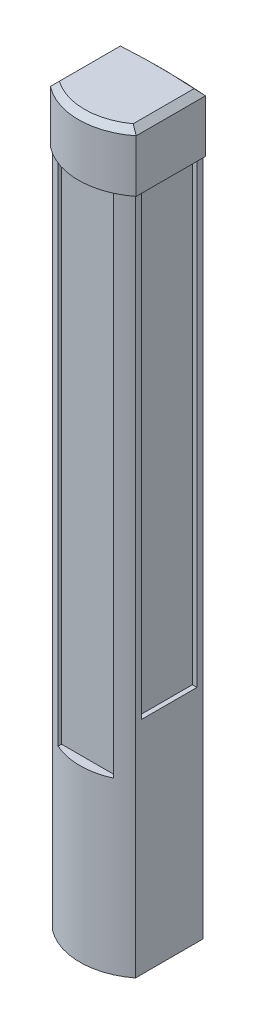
ISO-10303-21;
HEADER;
FILE_DESCRIPTION(('STEP AP214'),'2;1');
FILE_NAME('part.step','',(''),(''),'','','');
FILE_SCHEMA(('AUTOMOTIVE_DESIGN { 1 0 10303 214 1 1 1 1 }'));
ENDSEC;
DATA;
#1=APPLICATION_CONTEXT('core data for automotive mechanical design processes');
#2=APPLICATION_PROTOCOL_DEFINITION('international standard','automotive_design',2000,#1);
#3=PRODUCT_CONTEXT('',#1,'mechanical');
#4=PRODUCT('Part','Part','',(#3));
#5=PRODUCT_RELATED_PRODUCT_CATEGORY('part','',(#4));
#6=PRODUCT_DEFINITION_FORMATION('','',#4);
#7=PRODUCT_DEFINITION_CONTEXT('part definition',#1,'design');
#8=PRODUCT_DEFINITION('design','',#6,#7);
#9=PRODUCT_DEFINITION_SHAPE('','',#8);
#10=(LENGTH_UNIT() NAMED_UNIT(*) SI_UNIT(.MILLI.,.METRE.));
#11=(NAMED_UNIT(*) PLANE_ANGLE_UNIT() SI_UNIT($,.RADIAN.));
#12=(NAMED_UNIT(*) SI_UNIT($,.STERADIAN.) SOLID_ANGLE_UNIT());
#13=UNCERTAINTY_MEASURE_WITH_UNIT(LENGTH_MEASURE(1.E-05),#10,'distance_accuracy_value','');
#14=(GEOMETRIC_REPRESENTATION_CONTEXT(3) GLOBAL_UNCERTAINTY_ASSIGNED_CONTEXT((#13)) GLOBAL_UNIT_ASSIGNED_CONTEXT((#10,
#11,#12)) REPRESENTATION_CONTEXT('',''));
#15=CARTESIAN_POINT('',(0.,0.,0.));
#16=DIRECTION('',(0.,0.,1.));
#17=DIRECTION('',(1.,0.,0.));
#18=AXIS2_PLACEMENT_3D('',#15,#16,#17);
#19=CARTESIAN_POINT('',(90.1110219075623,1600.,-76.6253552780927));
#20=DIRECTION('',(-1.,0.,0.));
#21=DIRECTION('',(0.,0.,1.));
#22=AXIS2_PLACEMENT_3D('',#19,#20,#21);
#23=PLANE('',#22);
#24=DIRECTION('',(0.,0.,-1.));
#25=VECTOR('',#24,1.);
#26=CARTESIAN_POINT('',(90.1110219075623,1473.,59.6709747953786));
#27=LINE('',#26,#25);
#28=CARTESIAN_POINT('',(90.1110219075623,1473.,59.6709747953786));
#29=VERTEX_POINT('',#28);
#30=CARTESIAN_POINT('',(90.1110219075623,1473.,46.6709747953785));
#31=VERTEX_POINT('',#30);
#32=EDGE_CURVE('E522',#29,#31,#27,.T.);
#33=ORIENTED_EDGE('',*,*,#32,.F.);
#34=DIRECTION('',(0.,-1.,0.));
#35=VECTOR('',#34,1.);
#36=CARTESIAN_POINT('',(90.1110219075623,1600.,59.6709747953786));
#37=LINE('',#36,#35);
#38=CARTESIAN_POINT('',(90.1110219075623,0.,59.6709747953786));
#39=VERTEX_POINT('',#38);
#40=EDGE_CURVE('E401',#29,#39,#37,.T.);
#41=ORIENTED_EDGE('',*,*,#40,.T.);
#42=DIRECTION('',(0.,0.,-1.));
#43=VECTOR('',#42,1.);
#44=CARTESIAN_POINT('',(90.1110219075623,0.,-76.6253552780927));
#45=LINE('',#44,#43);
#46=CARTESIAN_POINT('',(90.1110219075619,0.,-86.8585656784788));
#47=VERTEX_POINT('',#46);
#48=EDGE_CURVE('E398',#39,#47,#45,.T.);
#49=ORIENTED_EDGE('',*,*,#48,.T.);
#50=DIRECTION('',(0.,-1.,0.));
#51=VECTOR('',#50,1.);
#52=CARTESIAN_POINT('',(90.1110219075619,1600.,-86.8585656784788));
#53=LINE('',#52,#51);
#54=CARTESIAN_POINT('',(90.1110219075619,1473.,-86.8585656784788));
#55=VERTEX_POINT('',#54);
#56=EDGE_CURVE('E407',#55,#47,#53,.T.);
#57=ORIENTED_EDGE('',*,*,#56,.F.);
#58=CARTESIAN_POINT('',(90.1110219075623,1473.,-74.0912342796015));
#59=VERTEX_POINT('',#58);
#60=EDGE_CURVE('E512',#59,#55,#27,.T.);
#61=ORIENTED_EDGE('',*,*,#60,.F.);
#62=DIRECTION('',(0.,-1.,0.));
#63=VECTOR('',#62,1.);
#64=CARTESIAN_POINT('',(90.1110219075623,1475.,-74.0912342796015));
#65=LINE('',#64,#63);
#66=CARTESIAN_POINT('',(90.1110219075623,480.,-74.0912342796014));
#67=VERTEX_POINT('',#66);
#68=EDGE_CURVE('E296',#59,#67,#65,.T.);
#69=ORIENTED_EDGE('',*,*,#68,.T.);
#70=DIRECTION('',(0.,0.,1.));
#71=VECTOR('',#70,1.);
#72=CARTESIAN_POINT('',(90.1110219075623,480.,-74.0912342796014));
#73=LINE('',#72,#71);
#74=CARTESIAN_POINT('',(90.1110219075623,480.,46.6709747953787));
#75=VERTEX_POINT('',#74);
#76=EDGE_CURVE('E306',#67,#75,#73,.T.);
#77=ORIENTED_EDGE('',*,*,#76,.T.);
#78=DIRECTION('',(0.,1.,0.));
#79=VECTOR('',#78,1.);
#80=CARTESIAN_POINT('',(90.1110219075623,1475.,46.6709747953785));
#81=LINE('',#80,#79);
#82=EDGE_CURVE('E319',#75,#31,#81,.T.);
#83=ORIENTED_EDGE('',*,*,#82,.T.);
#84=EDGE_LOOP('',(#33,#41,#49,#57,#61,#69,#77,#83));
#85=FACE_BOUND('',#84,.T.);
#86=ADVANCED_FACE('F40',(#85),#23,.F.);
#87=CARTESIAN_POINT('',(0.,1600.,-57.0674149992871));
#88=DIRECTION('',(0.,-1.,0.));
#89=DIRECTION('',(0.,0.,-1.));
#90=AXIS2_PLACEMENT_3D('',#87,#88,#89);
#91=CYLINDRICAL_SURFACE('',#90,147.471515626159);
#92=CARTESIAN_POINT('',(0.,1473.,-57.0674149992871));
#93=DIRECTION('',(0.,1.,0.));
#94=DIRECTION('',(0.,0.,1.));
#95=AXIS2_PLACEMENT_3D('',#92,#93,#94);
#96=CIRCLE('',#95,147.471515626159);
#97=CARTESIAN_POINT('',(60.1110219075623,1473.,77.5970308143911));
#98=VERTEX_POINT('',#97);
#99=EDGE_CURVE('E526',#98,#29,#96,.T.);
#100=ORIENTED_EDGE('',*,*,#99,.F.);
#101=DIRECTION('',(0.,-1.,0.));
#102=VECTOR('',#101,1.);
#103=CARTESIAN_POINT('',(60.1110219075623,1600.,77.5970308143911));
#104=LINE('',#103,#102);
#105=CARTESIAN_POINT('',(60.1110219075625,370.,77.5970308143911));
#106=VERTEX_POINT('',#105);
#107=EDGE_CURVE('E412',#98,#106,#104,.T.);
#108=ORIENTED_EDGE('',*,*,#107,.T.);
#109=CARTESIAN_POINT('',(0.,370.,-57.0674149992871));
#110=DIRECTION('',(0.,1.,0.));
#111=DIRECTION('',(0.,0.,1.));
#112=AXIS2_PLACEMENT_3D('',#109,#110,#111);
#113=CIRCLE('',#112,147.471515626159);
#114=CARTESIAN_POINT('',(-60.1110219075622,370.,77.5970308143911));
#115=VERTEX_POINT('',#114);
#116=EDGE_CURVE('E416',#115,#106,#113,.T.);
#117=ORIENTED_EDGE('',*,*,#116,.F.);
#118=DIRECTION('',(0.,-1.,0.));
#119=VECTOR('',#118,1.);
#120=CARTESIAN_POINT('',(-60.1110219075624,1600.,77.597030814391));
#121=LINE('',#120,#119);
#122=CARTESIAN_POINT('',(-60.1110219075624,1473.,77.597030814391));
#123=VERTEX_POINT('',#122);
#124=EDGE_CURVE('E419',#123,#115,#121,.T.);
#125=ORIENTED_EDGE('',*,*,#124,.F.);
#126=CARTESIAN_POINT('',(-90.1110219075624,1473.,59.6709747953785));
#127=VERTEX_POINT('',#126);
#128=EDGE_CURVE('E520',#127,#123,#96,.T.);
#129=ORIENTED_EDGE('',*,*,#128,.F.);
#130=DIRECTION('',(0.,-1.,0.));
#131=VECTOR('',#130,1.);
#132=CARTESIAN_POINT('',(-90.1110219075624,1600.,59.6709747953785));
#133=LINE('',#132,#131);
#134=CARTESIAN_POINT('',(-90.1110219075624,0.,59.6709747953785));
#135=VERTEX_POINT('',#134);
#136=EDGE_CURVE('E403',#127,#135,#133,.T.);
#137=ORIENTED_EDGE('',*,*,#136,.T.);
#138=CARTESIAN_POINT('',(0.,0.,-57.0674149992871));
#139=DIRECTION('',(0.,1.,0.));
#140=DIRECTION('',(0.,0.,1.));
#141=AXIS2_PLACEMENT_3D('',#138,#139,#140);
#142=CIRCLE('',#141,147.471515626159);
#143=EDGE_CURVE('E395',#135,#39,#142,.T.);
#144=ORIENTED_EDGE('',*,*,#143,.T.);
#145=ORIENTED_EDGE('',*,*,#40,.F.);
#146=EDGE_LOOP('',(#100,#108,#117,#125,#129,#137,#144,#145));
#147=FACE_BOUND('',#146,.T.);
#148=ADVANCED_FACE('F484',(#147),#91,.T.);
#149=CARTESIAN_POINT('',(-1.52671845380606,1600.,1095.60117065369));
#150=DIRECTION('',(0.,-1.,0.));
#151=DIRECTION('',(0.,0.,-1.));
#152=AXIS2_PLACEMENT_3D('',#149,#150,#151);
#153=CYLINDRICAL_SURFACE('',#152,1186.00527128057);
#154=CARTESIAN_POINT('',(-1.52671845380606,1473.,1095.60117065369));
#155=DIRECTION('',(0.,1.,0.));
#156=DIRECTION('',(0.,0.,1.));
#157=AXIS2_PLACEMENT_3D('',#154,#155,#156);
#158=CIRCLE('',#157,1186.00527128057);
#159=CARTESIAN_POINT('',(60.1110219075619,1473.,-88.8013337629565));
#160=VERTEX_POINT('',#159);
#161=EDGE_CURVE('E504',#55,#160,#158,.T.);
#162=ORIENTED_EDGE('',*,*,#161,.F.);
#163=ORIENTED_EDGE('',*,*,#56,.T.);
#164=CARTESIAN_POINT('',(-1.52671845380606,0.,1095.60117065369));
#165=DIRECTION('',(0.,1.,0.));
#166=DIRECTION('',(0.,0.,-1.));
#167=AXIS2_PLACEMENT_3D('',#164,#165,#166);
#168=CIRCLE('',#167,1186.00527128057);
#169=CARTESIAN_POINT('',(-90.1110219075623,0.,-87.0912342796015));
#170=VERTEX_POINT('',#169);
#171=EDGE_CURVE('E389',#47,#170,#168,.T.);
#172=ORIENTED_EDGE('',*,*,#171,.T.);
#173=DIRECTION('',(0.,-1.,0.));
#174=VECTOR('',#173,1.);
#175=CARTESIAN_POINT('',(-90.1110219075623,1600.,-87.0912342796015));
#176=LINE('',#175,#174);
#177=CARTESIAN_POINT('',(-90.1110219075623,1473.,-87.0912342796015));
#178=VERTEX_POINT('',#177);
#179=EDGE_CURVE('E405',#178,#170,#176,.T.);
#180=ORIENTED_EDGE('',*,*,#179,.F.);
#181=CARTESIAN_POINT('',(-60.1110219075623,1473.,-88.9562922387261));
#182=VERTEX_POINT('',#181);
#183=EDGE_CURVE('E511',#182,#178,#158,.T.);
#184=ORIENTED_EDGE('',*,*,#183,.F.);
#185=DIRECTION('',(0.,-1.,0.));
#186=VECTOR('',#185,1.);
#187=CARTESIAN_POINT('',(-60.1110219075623,1600.,-88.9562922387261));
#188=LINE('',#187,#186);
#189=CARTESIAN_POINT('',(-60.1110219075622,475.,-88.9562922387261));
#190=VERTEX_POINT('',#189);
#191=EDGE_CURVE('E426',#182,#190,#188,.T.);
#192=ORIENTED_EDGE('',*,*,#191,.T.);
#193=CARTESIAN_POINT('',(-1.52671845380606,475.,1095.60117065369));
#194=DIRECTION('',(0.,-1.,0.));
#195=DIRECTION('',(0.,0.,-1.));
#196=AXIS2_PLACEMENT_3D('',#193,#194,#195);
#197=CIRCLE('',#196,1186.00527128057);
#198=CARTESIAN_POINT('',(60.111021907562,475.,-88.8013337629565));
#199=VERTEX_POINT('',#198);
#200=EDGE_CURVE('E430',#190,#199,#197,.T.);
#201=ORIENTED_EDGE('',*,*,#200,.T.);
#202=DIRECTION('',(0.,-1.,0.));
#203=VECTOR('',#202,1.);
#204=CARTESIAN_POINT('',(60.1110219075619,1600.,-88.8013337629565));
#205=LINE('',#204,#203);
#206=EDGE_CURVE('E433',#199,#160,#205,.F.);
#207=ORIENTED_EDGE('',*,*,#206,.T.);
#208=EDGE_LOOP('',(#162,#163,#172,#180,#184,#192,#201,#207));
#209=FACE_BOUND('',#208,.T.);
#210=ADVANCED_FACE('F489',(#209),#153,.T.);
#211=CARTESIAN_POINT('',(-90.1110219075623,1600.,-75.9416108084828));
#212=DIRECTION('',(1.,0.,0.));
#213=DIRECTION('',(0.,0.,-1.));
#214=AXIS2_PLACEMENT_3D('',#211,#212,#213);
#215=PLANE('',#214);
#216=DIRECTION('',(0.,0.,1.));
#217=VECTOR('',#216,1.);
#218=CARTESIAN_POINT('',(-90.1110219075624,1473.,-87.0912342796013));
#219=LINE('',#218,#217);
#220=CARTESIAN_POINT('',(-90.1110219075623,1473.,-74.0912342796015));
#221=VERTEX_POINT('',#220);
#222=EDGE_CURVE('E262',#178,#221,#219,.T.);
#223=ORIENTED_EDGE('',*,*,#222,.F.);
#224=ORIENTED_EDGE('',*,*,#179,.T.);
#225=DIRECTION('',(0.,0.,1.));
#226=VECTOR('',#225,1.);
#227=CARTESIAN_POINT('',(-90.1110219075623,0.,-75.9416108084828));
#228=LINE('',#227,#226);
#229=EDGE_CURVE('E392',#170,#135,#228,.T.);
#230=ORIENTED_EDGE('',*,*,#229,.T.);
#231=ORIENTED_EDGE('',*,*,#136,.F.);
#232=CARTESIAN_POINT('',(-90.1110219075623,1473.,46.6709747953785));
#233=VERTEX_POINT('',#232);
#234=EDGE_CURVE('E267',#233,#127,#219,.T.);
#235=ORIENTED_EDGE('',*,*,#234,.F.);
#236=DIRECTION('',(0.,1.,0.));
#237=VECTOR('',#236,1.);
#238=CARTESIAN_POINT('',(-90.1110219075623,1475.,46.6709747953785));
#239=LINE('',#238,#237);
#240=CARTESIAN_POINT('',(-90.1110219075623,480.,46.6709747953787));
#241=VERTEX_POINT('',#240);
#242=EDGE_CURVE('E355',#241,#233,#239,.T.);
#243=ORIENTED_EDGE('',*,*,#242,.F.);
#244=DIRECTION('',(0.,0.,1.));
#245=VECTOR('',#244,1.);
#246=CARTESIAN_POINT('',(-90.1110219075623,480.,-74.0912342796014));
#247=LINE('',#246,#245);
#248=CARTESIAN_POINT('',(-90.1110219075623,480.,-74.0912342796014));
#249=VERTEX_POINT('',#248);
#250=EDGE_CURVE('E351',#249,#241,#247,.T.);
#251=ORIENTED_EDGE('',*,*,#250,.F.);
#252=DIRECTION('',(0.,-1.,0.));
#253=VECTOR('',#252,1.);
#254=CARTESIAN_POINT('',(-90.1110219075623,1475.,-74.0912342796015));
#255=LINE('',#254,#253);
#256=EDGE_CURVE('E327',#221,#249,#255,.T.);
#257=ORIENTED_EDGE('',*,*,#256,.F.);
#258=EDGE_LOOP('',(#223,#224,#230,#231,#235,#243,#251,#257));
#259=FACE_BOUND('',#258,.T.);
#260=ADVANCED_FACE('F496',(#259),#215,.F.);
#261=CARTESIAN_POINT('',(-1.52671845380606,0.,1095.60117065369));
#262=DIRECTION('',(0.,-1.,0.));
#263=DIRECTION('',(0.,0.,-1.));
#264=AXIS2_PLACEMENT_3D('',#261,#262,#263);
#265=PLANE('',#264);
#266=ORIENTED_EDGE('',*,*,#171,.F.);
#267=ORIENTED_EDGE('',*,*,#48,.F.);
#268=ORIENTED_EDGE('',*,*,#143,.F.);
#269=ORIENTED_EDGE('',*,*,#229,.F.);
#270=EDGE_LOOP('',(#266,#267,#268,#269));
#271=FACE_BOUND('',#270,.T.);
#272=ADVANCED_FACE('F493',(#271),#265,.T.);
#273=CARTESIAN_POINT('',(-60.1110219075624,1475.,100.));
#274=DIRECTION('',(1.,0.,0.));
#275=DIRECTION('',(0.,1.,0.));
#276=AXIS2_PLACEMENT_3D('',#273,#274,#275);
#277=PLANE('',#276);
#278=CARTESIAN_POINT('',(-60.1110219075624,1475.,77.597030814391));
#279=VERTEX_POINT('',#278);
#280=EDGE_CURVE('E420',#279,#123,#121,.T.);
#281=ORIENTED_EDGE('',*,*,#280,.T.);
#282=ORIENTED_EDGE('',*,*,#124,.T.);
#283=DIRECTION('',(0.,0.,-1.));
#284=VECTOR('',#283,1.);
#285=CARTESIAN_POINT('',(-60.1110219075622,370.,100.));
#286=LINE('',#285,#284);
#287=CARTESIAN_POINT('',(-60.1110219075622,370.,70.));
#288=VERTEX_POINT('',#287);
#289=EDGE_CURVE('E387',#115,#288,#286,.T.);
#290=ORIENTED_EDGE('',*,*,#289,.T.);
#291=DIRECTION('',(0.,-1.,0.));
#292=VECTOR('',#291,1.);
#293=CARTESIAN_POINT('',(-60.1110219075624,1475.,70.));
#294=LINE('',#293,#292);
#295=CARTESIAN_POINT('',(-60.1110219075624,1475.,70.));
#296=VERTEX_POINT('',#295);
#297=EDGE_CURVE('E362',#296,#288,#294,.T.);
#298=ORIENTED_EDGE('',*,*,#297,.F.);
#299=DIRECTION('',(0.,0.,-1.));
#300=VECTOR('',#299,1.);
#301=CARTESIAN_POINT('',(-60.1110219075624,1475.,100.));
#302=LINE('',#301,#300);
#303=EDGE_CURVE('E381',#279,#296,#302,.T.);
#304=ORIENTED_EDGE('',*,*,#303,.F.);
#305=EDGE_LOOP('',(#281,#282,#290,#298,#304));
#306=FACE_BOUND('',#305,.T.);
#307=ADVANCED_FACE('F606',(#306),#277,.T.);
#308=CARTESIAN_POINT('',(-60.1110219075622,370.,100.));
#309=DIRECTION('',(0.,1.,0.));
#310=DIRECTION('',(0.,0.,1.));
#311=AXIS2_PLACEMENT_3D('',#308,#309,#310);
#312=PLANE('',#311);
#313=ORIENTED_EDGE('',*,*,#116,.T.);
#314=DIRECTION('',(0.,0.,-1.));
#315=VECTOR('',#314,1.);
#316=CARTESIAN_POINT('',(60.1110219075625,370.,100.));
#317=LINE('',#316,#315);
#318=CARTESIAN_POINT('',(60.1110219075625,370.,70.));
#319=VERTEX_POINT('',#318);
#320=EDGE_CURVE('E385',#106,#319,#317,.T.);
#321=ORIENTED_EDGE('',*,*,#320,.T.);
#322=DIRECTION('',(1.,0.,0.));
#323=VECTOR('',#322,1.);
#324=CARTESIAN_POINT('',(-60.1110219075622,370.,70.));
#325=LINE('',#324,#323);
#326=EDGE_CURVE('E372',#288,#319,#325,.T.);
#327=ORIENTED_EDGE('',*,*,#326,.F.);
#328=ORIENTED_EDGE('',*,*,#289,.F.);
#329=EDGE_LOOP('',(#313,#321,#327,#328));
#330=FACE_BOUND('',#329,.T.);
#331=ADVANCED_FACE('F602',(#330),#312,.T.);
#332=CARTESIAN_POINT('',(60.1110219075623,1475.,100.));
#333=DIRECTION('',(1.,0.,0.));
#334=DIRECTION('',(0.,1.,0.));
#335=AXIS2_PLACEMENT_3D('',#332,#333,#334);
#336=PLANE('',#335);
#337=DIRECTION('',(0.,0.,-1.));
#338=VECTOR('',#337,1.);
#339=CARTESIAN_POINT('',(60.1110219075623,1475.,100.));
#340=LINE('',#339,#338);
#341=CARTESIAN_POINT('',(60.1110219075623,1475.,77.5970308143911));
#342=VERTEX_POINT('',#341);
#343=CARTESIAN_POINT('',(60.1110219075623,1475.,70.));
#344=VERTEX_POINT('',#343);
#345=EDGE_CURVE('E383',#342,#344,#340,.T.);
#346=ORIENTED_EDGE('',*,*,#345,.T.);
#347=DIRECTION('',(0.,-1.,0.));
#348=VECTOR('',#347,1.);
#349=CARTESIAN_POINT('',(60.1110219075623,1475.,70.));
#350=LINE('',#349,#348);
#351=EDGE_CURVE('E375',#344,#319,#350,.T.);
#352=ORIENTED_EDGE('',*,*,#351,.T.);
#353=ORIENTED_EDGE('',*,*,#320,.F.);
#354=ORIENTED_EDGE('',*,*,#107,.F.);
#355=EDGE_CURVE('E413',#342,#98,#104,.T.);
#356=ORIENTED_EDGE('',*,*,#355,.F.);
#357=EDGE_LOOP('',(#346,#352,#353,#354,#356));
#358=FACE_BOUND('',#357,.T.);
#359=ADVANCED_FACE('F598',(#358),#336,.F.);
#360=CARTESIAN_POINT('',(-60.1110219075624,1475.,100.));
#361=DIRECTION('',(0.,1.,0.));
#362=DIRECTION('',(0.,0.,1.));
#363=AXIS2_PLACEMENT_3D('',#360,#361,#362);
#364=PLANE('',#363);
#365=ORIENTED_EDGE('',*,*,#303,.T.);
#366=DIRECTION('',(1.,0.,0.));
#367=VECTOR('',#366,1.);
#368=CARTESIAN_POINT('',(-60.1110219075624,1475.,70.));
#369=LINE('',#368,#367);
#370=EDGE_CURVE('E378',#296,#344,#369,.T.);
#371=ORIENTED_EDGE('',*,*,#370,.T.);
#372=ORIENTED_EDGE('',*,*,#345,.F.);
#373=CARTESIAN_POINT('',(0.,1475.,-57.0674149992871));
#374=DIRECTION('',(0.,1.,0.));
#375=DIRECTION('',(0.,0.,1.));
#376=AXIS2_PLACEMENT_3D('',#373,#374,#375);
#377=CIRCLE('',#376,147.471515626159);
#378=EDGE_CURVE('E409',#279,#342,#377,.T.);
#379=ORIENTED_EDGE('',*,*,#378,.F.);
#380=EDGE_LOOP('',(#365,#371,#372,#379));
#381=FACE_BOUND('',#380,.T.);
#382=ADVANCED_FACE('F590',(#381),#364,.F.);
#383=CARTESIAN_POINT('',(0.,0.,70.));
#384=DIRECTION('',(0.,0.,1.));
#385=DIRECTION('',(1.,0.,0.));
#386=AXIS2_PLACEMENT_3D('',#383,#384,#385);
#387=PLANE('',#386);
#388=ORIENTED_EDGE('',*,*,#297,.T.);
#389=ORIENTED_EDGE('',*,*,#326,.T.);
#390=ORIENTED_EDGE('',*,*,#351,.F.);
#391=ORIENTED_EDGE('',*,*,#370,.F.);
#392=EDGE_LOOP('',(#388,#389,#390,#391));
#393=FACE_BOUND('',#392,.T.);
#394=ADVANCED_FACE('F583',(#393),#387,.T.);
#395=CARTESIAN_POINT('',(-80.1110219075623,1475.,-74.0912342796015));
#396=DIRECTION('',(0.,0.,-1.));
#397=DIRECTION('',(0.,1.,0.));
#398=AXIS2_PLACEMENT_3D('',#395,#396,#397);
#399=PLANE('',#398);
#400=CARTESIAN_POINT('',(-90.1110219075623,1475.,-74.0912342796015));
#401=VERTEX_POINT('',#400);
#402=EDGE_CURVE('E348',#401,#221,#255,.T.);
#403=ORIENTED_EDGE('',*,*,#402,.T.);
#404=ORIENTED_EDGE('',*,*,#256,.T.);
#405=DIRECTION('',(-1.,0.,0.));
#406=VECTOR('',#405,1.);
#407=CARTESIAN_POINT('',(-80.1110219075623,480.,-74.0912342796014));
#408=LINE('',#407,#406);
#409=CARTESIAN_POINT('',(-80.1110219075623,480.,-74.0912342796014));
#410=VERTEX_POINT('',#409);
#411=EDGE_CURVE('E347',#410,#249,#408,.T.);
#412=ORIENTED_EDGE('',*,*,#411,.F.);
#413=DIRECTION('',(0.,-1.,0.));
#414=VECTOR('',#413,1.);
#415=CARTESIAN_POINT('',(-80.1110219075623,1475.,-74.0912342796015));
#416=LINE('',#415,#414);
#417=CARTESIAN_POINT('',(-80.1110219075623,1475.,-74.0912342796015));
#418=VERTEX_POINT('',#417);
#419=EDGE_CURVE('E334',#418,#410,#416,.T.);
#420=ORIENTED_EDGE('',*,*,#419,.F.);
#421=DIRECTION('',(-1.,0.,0.));
#422=VECTOR('',#421,1.);
#423=CARTESIAN_POINT('',(-80.1110219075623,1475.,-74.0912342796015));
#424=LINE('',#423,#422);
#425=EDGE_CURVE('E360',#418,#401,#424,.T.);
#426=ORIENTED_EDGE('',*,*,#425,.T.);
#427=EDGE_LOOP('',(#403,#404,#412,#420,#426));
#428=FACE_BOUND('',#427,.T.);
#429=ADVANCED_FACE('F581',(#428),#399,.F.);
#430=CARTESIAN_POINT('',(-80.1110219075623,1475.,-74.0912342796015));
#431=DIRECTION('',(0.,1.,0.));
#432=DIRECTION('',(0.,0.,1.));
#433=AXIS2_PLACEMENT_3D('',#430,#431,#432);
#434=PLANE('',#433);
#435=DIRECTION('',(0.,0.,-1.));
#436=VECTOR('',#435,1.);
#437=CARTESIAN_POINT('',(-90.1110219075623,1475.,-74.0912342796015));
#438=LINE('',#437,#436);
#439=CARTESIAN_POINT('',(-90.1110219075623,1475.,46.6709747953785));
#440=VERTEX_POINT('',#439);
#441=EDGE_CURVE('E338',#440,#401,#438,.T.);
#442=ORIENTED_EDGE('',*,*,#441,.T.);
#443=ORIENTED_EDGE('',*,*,#425,.F.);
#444=DIRECTION('',(0.,0.,-1.));
#445=VECTOR('',#444,1.);
#446=CARTESIAN_POINT('',(-80.1110219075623,1475.,-74.0912342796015));
#447=LINE('',#446,#445);
#448=CARTESIAN_POINT('',(-80.1110219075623,1475.,46.6709747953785));
#449=VERTEX_POINT('',#448);
#450=EDGE_CURVE('E344',#449,#418,#447,.T.);
#451=ORIENTED_EDGE('',*,*,#450,.F.);
#452=DIRECTION('',(-1.,0.,0.));
#453=VECTOR('',#452,1.);
#454=CARTESIAN_POINT('',(-80.1110219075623,1475.,46.6709747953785));
#455=LINE('',#454,#453);
#456=EDGE_CURVE('E363',#449,#440,#455,.T.);
#457=ORIENTED_EDGE('',*,*,#456,.T.);
#458=EDGE_LOOP('',(#442,#443,#451,#457));
#459=FACE_BOUND('',#458,.T.);
#460=ADVANCED_FACE('F572',(#459),#434,.F.);
#461=CARTESIAN_POINT('',(-80.1110219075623,1475.,46.6709747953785));
#462=DIRECTION('',(0.,0.,1.));
#463=DIRECTION('',(0.,-1.,0.));
#464=AXIS2_PLACEMENT_3D('',#461,#462,#463);
#465=PLANE('',#464);
#466=ORIENTED_EDGE('',*,*,#242,.T.);
#467=EDGE_CURVE('E354',#233,#440,#239,.T.);
#468=ORIENTED_EDGE('',*,*,#467,.T.);
#469=ORIENTED_EDGE('',*,*,#456,.F.);
#470=DIRECTION('',(0.,1.,0.));
#471=VECTOR('',#470,1.);
#472=CARTESIAN_POINT('',(-80.1110219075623,1475.,46.6709747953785));
#473=LINE('',#472,#471);
#474=CARTESIAN_POINT('',(-80.1110219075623,480.,46.6709747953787));
#475=VERTEX_POINT('',#474);
#476=EDGE_CURVE('E341',#475,#449,#473,.T.);
#477=ORIENTED_EDGE('',*,*,#476,.F.);
#478=DIRECTION('',(-1.,0.,0.));
#479=VECTOR('',#478,1.);
#480=CARTESIAN_POINT('',(-80.1110219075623,480.,46.6709747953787));
#481=LINE('',#480,#479);
#482=EDGE_CURVE('E366',#475,#241,#481,.T.);
#483=ORIENTED_EDGE('',*,*,#482,.T.);
#484=EDGE_LOOP('',(#466,#468,#469,#477,#483));
#485=FACE_BOUND('',#484,.T.);
#486=ADVANCED_FACE('F568',(#485),#465,.F.);
#487=CARTESIAN_POINT('',(-80.1110219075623,480.,-74.0912342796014));
#488=DIRECTION('',(0.,-1.,0.));
#489=DIRECTION('',(0.,0.,-1.));
#490=AXIS2_PLACEMENT_3D('',#487,#488,#489);
#491=PLANE('',#490);
#492=ORIENTED_EDGE('',*,*,#250,.T.);
#493=ORIENTED_EDGE('',*,*,#482,.F.);
#494=DIRECTION('',(0.,0.,1.));
#495=VECTOR('',#494,1.);
#496=CARTESIAN_POINT('',(-80.1110219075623,480.,-74.0912342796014));
#497=LINE('',#496,#495);
#498=EDGE_CURVE('E337',#410,#475,#497,.T.);
#499=ORIENTED_EDGE('',*,*,#498,.F.);
#500=ORIENTED_EDGE('',*,*,#411,.T.);
#501=EDGE_LOOP('',(#492,#493,#499,#500));
#502=FACE_BOUND('',#501,.T.);
#503=ADVANCED_FACE('F579',(#502),#491,.F.);
#504=CARTESIAN_POINT('',(-80.1110219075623,0.,0.));
#505=DIRECTION('',(-1.,0.,0.));
#506=DIRECTION('',(0.,0.,1.));
#507=AXIS2_PLACEMENT_3D('',#504,#505,#506);
#508=PLANE('',#507);
#509=ORIENTED_EDGE('',*,*,#419,.T.);
#510=ORIENTED_EDGE('',*,*,#498,.T.);
#511=ORIENTED_EDGE('',*,*,#476,.T.);
#512=ORIENTED_EDGE('',*,*,#450,.T.);
#513=EDGE_LOOP('',(#509,#510,#511,#512));
#514=FACE_BOUND('',#513,.T.);
#515=ADVANCED_FACE('F575',(#514),#508,.T.);
#516=CARTESIAN_POINT('',(80.1110219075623,1475.,-74.0912342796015));
#517=DIRECTION('',(0.,0.,1.));
#518=DIRECTION('',(0.,-1.,0.));
#519=AXIS2_PLACEMENT_3D('',#516,#517,#518);
#520=PLANE('',#519);
#521=CARTESIAN_POINT('',(90.1110219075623,1475.,-74.0912342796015));
#522=VERTEX_POINT('',#521);
#523=EDGE_CURVE('E313',#522,#59,#65,.T.);
#524=ORIENTED_EDGE('',*,*,#523,.F.);
#525=DIRECTION('',(1.,0.,0.));
#526=VECTOR('',#525,1.);
#527=CARTESIAN_POINT('',(80.1110219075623,1475.,-74.0912342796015));
#528=LINE('',#527,#526);
#529=CARTESIAN_POINT('',(80.1110219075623,1475.,-74.0912342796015));
#530=VERTEX_POINT('',#529);
#531=EDGE_CURVE('E312',#530,#522,#528,.T.);
#532=ORIENTED_EDGE('',*,*,#531,.F.);
#533=DIRECTION('',(0.,-1.,0.));
#534=VECTOR('',#533,1.);
#535=CARTESIAN_POINT('',(80.1110219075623,1475.,-74.0912342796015));
#536=LINE('',#535,#534);
#537=CARTESIAN_POINT('',(80.1110219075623,480.,-74.0912342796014));
#538=VERTEX_POINT('',#537);
#539=EDGE_CURVE('E302',#530,#538,#536,.T.);
#540=ORIENTED_EDGE('',*,*,#539,.T.);
#541=DIRECTION('',(1.,0.,0.));
#542=VECTOR('',#541,1.);
#543=CARTESIAN_POINT('',(80.1110219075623,480.,-74.0912342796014));
#544=LINE('',#543,#542);
#545=EDGE_CURVE('E324',#538,#67,#544,.T.);
#546=ORIENTED_EDGE('',*,*,#545,.T.);
#547=ORIENTED_EDGE('',*,*,#68,.F.);
#548=EDGE_LOOP('',(#524,#532,#540,#546,#547));
#549=FACE_BOUND('',#548,.T.);
#550=ADVANCED_FACE('F684',(#549),#520,.T.);
#551=CARTESIAN_POINT('',(80.1110219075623,480.,-74.0912342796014));
#552=DIRECTION('',(0.,1.,0.));
#553=DIRECTION('',(0.,0.,1.));
#554=AXIS2_PLACEMENT_3D('',#551,#552,#553);
#555=PLANE('',#554);
#556=ORIENTED_EDGE('',*,*,#76,.F.);
#557=ORIENTED_EDGE('',*,*,#545,.F.);
#558=DIRECTION('',(0.,0.,1.));
#559=VECTOR('',#558,1.);
#560=CARTESIAN_POINT('',(80.1110219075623,480.,-74.0912342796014));
#561=LINE('',#560,#559);
#562=CARTESIAN_POINT('',(80.1110219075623,480.,46.6709747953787));
#563=VERTEX_POINT('',#562);
#564=EDGE_CURVE('E310',#538,#563,#561,.T.);
#565=ORIENTED_EDGE('',*,*,#564,.T.);
#566=DIRECTION('',(1.,0.,0.));
#567=VECTOR('',#566,1.);
#568=CARTESIAN_POINT('',(80.1110219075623,480.,46.6709747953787));
#569=LINE('',#568,#567);
#570=EDGE_CURVE('E328',#563,#75,#569,.T.);
#571=ORIENTED_EDGE('',*,*,#570,.T.);
#572=EDGE_LOOP('',(#556,#557,#565,#571));
#573=FACE_BOUND('',#572,.T.);
#574=ADVANCED_FACE('F680',(#573),#555,.T.);
#575=CARTESIAN_POINT('',(80.1110219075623,1475.,46.6709747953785));
#576=DIRECTION('',(0.,0.,-1.));
#577=DIRECTION('',(0.,1.,0.));
#578=AXIS2_PLACEMENT_3D('',#575,#576,#577);
#579=PLANE('',#578);
#580=ORIENTED_EDGE('',*,*,#82,.F.);
#581=ORIENTED_EDGE('',*,*,#570,.F.);
#582=DIRECTION('',(0.,1.,0.));
#583=VECTOR('',#582,1.);
#584=CARTESIAN_POINT('',(80.1110219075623,1475.,46.6709747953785));
#585=LINE('',#584,#583);
#586=CARTESIAN_POINT('',(80.1110219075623,1475.,46.6709747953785));
#587=VERTEX_POINT('',#586);
#588=EDGE_CURVE('E308',#563,#587,#585,.T.);
#589=ORIENTED_EDGE('',*,*,#588,.T.);
#590=DIRECTION('',(1.,0.,0.));
#591=VECTOR('',#590,1.);
#592=CARTESIAN_POINT('',(80.1110219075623,1475.,46.6709747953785));
#593=LINE('',#592,#591);
#594=CARTESIAN_POINT('',(90.1110219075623,1475.,46.6709747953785));
#595=VERTEX_POINT('',#594);
#596=EDGE_CURVE('E330',#587,#595,#593,.T.);
#597=ORIENTED_EDGE('',*,*,#596,.T.);
#598=DIRECTION('',(0.,-1.,0.));
#599=VECTOR('',#598,1.);
#600=CARTESIAN_POINT('',(90.1110219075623,1475.,46.6709747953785));
#601=LINE('',#600,#599);
#602=EDGE_CURVE('E279',#595,#31,#601,.T.);
#603=ORIENTED_EDGE('',*,*,#602,.T.);
#604=EDGE_LOOP('',(#580,#581,#589,#597,#603));
#605=FACE_BOUND('',#604,.T.);
#606=ADVANCED_FACE('F683',(#605),#579,.T.);
#607=CARTESIAN_POINT('',(80.1110219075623,1475.,-74.0912342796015));
#608=DIRECTION('',(0.,-1.,0.));
#609=DIRECTION('',(0.,0.,-1.));
#610=AXIS2_PLACEMENT_3D('',#607,#608,#609);
#611=PLANE('',#610);
#612=DIRECTION('',(0.,0.,-1.));
#613=VECTOR('',#612,1.);
#614=CARTESIAN_POINT('',(90.1110219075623,1475.,-74.0912342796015));
#615=LINE('',#614,#613);
#616=EDGE_CURVE('E316',#595,#522,#615,.T.);
#617=ORIENTED_EDGE('',*,*,#616,.F.);
#618=ORIENTED_EDGE('',*,*,#596,.F.);
#619=DIRECTION('',(0.,0.,-1.));
#620=VECTOR('',#619,1.);
#621=CARTESIAN_POINT('',(80.1110219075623,1475.,-74.0912342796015));
#622=LINE('',#621,#620);
#623=EDGE_CURVE('E305',#587,#530,#622,.T.);
#624=ORIENTED_EDGE('',*,*,#623,.T.);
#625=ORIENTED_EDGE('',*,*,#531,.T.);
#626=EDGE_LOOP('',(#617,#618,#624,#625));
#627=FACE_BOUND('',#626,.T.);
#628=ADVANCED_FACE('F678',(#627),#611,.T.);
#629=CARTESIAN_POINT('',(80.1110219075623,0.,0.));
#630=DIRECTION('',(1.,0.,0.));
#631=DIRECTION('',(0.,0.,1.));
#632=AXIS2_PLACEMENT_3D('',#629,#630,#631);
#633=PLANE('',#632);
#634=ORIENTED_EDGE('',*,*,#539,.F.);
#635=ORIENTED_EDGE('',*,*,#623,.F.);
#636=ORIENTED_EDGE('',*,*,#588,.F.);
#637=ORIENTED_EDGE('',*,*,#564,.F.);
#638=EDGE_LOOP('',(#634,#635,#636,#637));
#639=FACE_BOUND('',#638,.T.);
#640=ADVANCED_FACE('F675',(#639),#633,.T.);
#641=CARTESIAN_POINT('',(60.1110219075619,1475.,-100.));
#642=DIRECTION('',(1.,0.,0.));
#643=DIRECTION('',(0.,1.,0.));
#644=AXIS2_PLACEMENT_3D('',#641,#642,#643);
#645=PLANE('',#644);
#646=DIRECTION('',(0.,0.,1.));
#647=VECTOR('',#646,1.);
#648=CARTESIAN_POINT('',(60.111021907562,475.,-100.));
#649=LINE('',#648,#647);
#650=CARTESIAN_POINT('',(60.111021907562,475.,-80.));
#651=VERTEX_POINT('',#650);
#652=EDGE_CURVE('E294',#199,#651,#649,.T.);
#653=ORIENTED_EDGE('',*,*,#652,.T.);
#654=DIRECTION('',(0.,1.,0.));
#655=VECTOR('',#654,1.);
#656=CARTESIAN_POINT('',(60.1110219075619,1475.,-80.));
#657=LINE('',#656,#655);
#658=CARTESIAN_POINT('',(60.1110219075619,1475.,-80.));
#659=VERTEX_POINT('',#658);
#660=EDGE_CURVE('E281',#651,#659,#657,.T.);
#661=ORIENTED_EDGE('',*,*,#660,.T.);
#662=DIRECTION('',(0.,0.,1.));
#663=VECTOR('',#662,1.);
#664=CARTESIAN_POINT('',(60.1110219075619,1475.,-100.));
#665=LINE('',#664,#663);
#666=CARTESIAN_POINT('',(60.1110219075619,1475.,-88.8013337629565));
#667=VERTEX_POINT('',#666);
#668=EDGE_CURVE('E293',#667,#659,#665,.T.);
#669=ORIENTED_EDGE('',*,*,#668,.F.);
#670=DIRECTION('',(0.,1.,0.));
#671=VECTOR('',#670,1.);
#672=CARTESIAN_POINT('',(60.1110219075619,1473.,-88.8013337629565));
#673=LINE('',#672,#671);
#674=EDGE_CURVE('E273',#160,#667,#673,.T.);
#675=ORIENTED_EDGE('',*,*,#674,.F.);
#676=ORIENTED_EDGE('',*,*,#206,.F.);
#677=EDGE_LOOP('',(#653,#661,#669,#675,#676));
#678=FACE_BOUND('',#677,.T.);
#679=ADVANCED_FACE('F546',(#678),#645,.F.);
#680=CARTESIAN_POINT('',(60.111021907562,475.,-100.));
#681=DIRECTION('',(0.,-1.,0.));
#682=DIRECTION('',(0.,0.,-1.));
#683=AXIS2_PLACEMENT_3D('',#680,#681,#682);
#684=PLANE('',#683);
#685=DIRECTION('',(0.,0.,1.));
#686=VECTOR('',#685,1.);
#687=CARTESIAN_POINT('',(-60.1110219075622,475.,-100.));
#688=LINE('',#687,#686);
#689=CARTESIAN_POINT('',(-60.1110219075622,475.,-80.));
#690=VERTEX_POINT('',#689);
#691=EDGE_CURVE('E297',#190,#690,#688,.T.);
#692=ORIENTED_EDGE('',*,*,#691,.T.);
#693=DIRECTION('',(1.,0.,0.));
#694=VECTOR('',#693,1.);
#695=CARTESIAN_POINT('',(60.111021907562,475.,-80.));
#696=LINE('',#695,#694);
#697=EDGE_CURVE('E290',#690,#651,#696,.T.);
#698=ORIENTED_EDGE('',*,*,#697,.T.);
#699=ORIENTED_EDGE('',*,*,#652,.F.);
#700=ORIENTED_EDGE('',*,*,#200,.F.);
#701=EDGE_LOOP('',(#692,#698,#699,#700));
#702=FACE_BOUND('',#701,.T.);
#703=ADVANCED_FACE('F550',(#702),#684,.F.);
#704=CARTESIAN_POINT('',(-60.1110219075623,1475.,-100.));
#705=DIRECTION('',(-1.,0.,0.));
#706=DIRECTION('',(0.,-1.,0.));
#707=AXIS2_PLACEMENT_3D('',#704,#705,#706);
#708=PLANE('',#707);
#709=DIRECTION('',(0.,0.,1.));
#710=VECTOR('',#709,1.);
#711=CARTESIAN_POINT('',(-60.1110219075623,1475.,-100.));
#712=LINE('',#711,#710);
#713=CARTESIAN_POINT('',(-60.1110219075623,1475.,-88.9562922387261));
#714=VERTEX_POINT('',#713);
#715=CARTESIAN_POINT('',(-60.1110219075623,1475.,-80.));
#716=VERTEX_POINT('',#715);
#717=EDGE_CURVE('E299',#714,#716,#712,.T.);
#718=ORIENTED_EDGE('',*,*,#717,.T.);
#719=DIRECTION('',(0.,-1.,0.));
#720=VECTOR('',#719,1.);
#721=CARTESIAN_POINT('',(-60.1110219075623,1475.,-80.));
#722=LINE('',#721,#720);
#723=EDGE_CURVE('E287',#716,#690,#722,.T.);
#724=ORIENTED_EDGE('',*,*,#723,.T.);
#725=ORIENTED_EDGE('',*,*,#691,.F.);
#726=ORIENTED_EDGE('',*,*,#191,.F.);
#727=EDGE_CURVE('E427',#714,#182,#188,.T.);
#728=ORIENTED_EDGE('',*,*,#727,.F.);
#729=EDGE_LOOP('',(#718,#724,#725,#726,#728));
#730=FACE_BOUND('',#729,.T.);
#731=ADVANCED_FACE('F534',(#730),#708,.F.);
#732=CARTESIAN_POINT('',(60.1110219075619,1475.,-100.));
#733=DIRECTION('',(0.,1.,0.));
#734=DIRECTION('',(0.,0.,1.));
#735=AXIS2_PLACEMENT_3D('',#732,#733,#734);
#736=PLANE('',#735);
#737=ORIENTED_EDGE('',*,*,#668,.T.);
#738=DIRECTION('',(-1.,0.,0.));
#739=VECTOR('',#738,1.);
#740=CARTESIAN_POINT('',(60.1110219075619,1475.,-80.));
#741=LINE('',#740,#739);
#742=EDGE_CURVE('E284',#659,#716,#741,.T.);
#743=ORIENTED_EDGE('',*,*,#742,.T.);
#744=ORIENTED_EDGE('',*,*,#717,.F.);
#745=CARTESIAN_POINT('',(-1.52671845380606,1475.,1095.60117065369));
#746=DIRECTION('',(0.,1.,0.));
#747=DIRECTION('',(0.,0.,1.));
#748=AXIS2_PLACEMENT_3D('',#745,#746,#747);
#749=CIRCLE('',#748,1186.00527128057);
#750=EDGE_CURVE('E423',#667,#714,#749,.T.);
#751=ORIENTED_EDGE('',*,*,#750,.F.);
#752=EDGE_LOOP('',(#737,#743,#744,#751));
#753=FACE_BOUND('',#752,.T.);
#754=ADVANCED_FACE('F538',(#753),#736,.F.);
#755=CARTESIAN_POINT('',(0.,0.,-80.));
#756=DIRECTION('',(0.,0.,-1.));
#757=DIRECTION('',(-1.,0.,0.));
#758=AXIS2_PLACEMENT_3D('',#755,#756,#757);
#759=PLANE('',#758);
#760=ORIENTED_EDGE('',*,*,#660,.F.);
#761=ORIENTED_EDGE('',*,*,#697,.F.);
#762=ORIENTED_EDGE('',*,*,#723,.F.);
#763=ORIENTED_EDGE('',*,*,#742,.F.);
#764=EDGE_LOOP('',(#760,#761,#762,#763));
#765=FACE_BOUND('',#764,.T.);
#766=ADVANCED_FACE('F543',(#765),#759,.T.);
#767=CARTESIAN_POINT('',(-90.1110219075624,1473.,-87.0912342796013));
#768=DIRECTION('',(-1.,0.,0.));
#769=DIRECTION('',(0.,0.,1.));
#770=AXIS2_PLACEMENT_3D('',#767,#768,#769);
#771=PLANE('',#770);
#772=EDGE_CURVE('E265',#221,#233,#219,.T.);
#773=ORIENTED_EDGE('',*,*,#772,.F.);
#774=ORIENTED_EDGE('',*,*,#402,.F.);
#775=ORIENTED_EDGE('',*,*,#441,.F.);
#776=ORIENTED_EDGE('',*,*,#467,.F.);
#777=EDGE_LOOP('',(#773,#774,#775,#776));
#778=FACE_BOUND('',#777,.T.);
#779=ADVANCED_FACE('F565',(#778),#771,.F.);
#780=CARTESIAN_POINT('',(-1.52671845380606,1473.,1095.60117065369));
#781=DIRECTION('',(0.,1.,0.));
#782=DIRECTION('',(0.,0.,1.));
#783=AXIS2_PLACEMENT_3D('',#780,#781,#782);
#784=CYLINDRICAL_SURFACE('',#783,1186.00527128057);
#785=EDGE_CURVE('E510',#160,#182,#158,.T.);
#786=ORIENTED_EDGE('',*,*,#785,.F.);
#787=ORIENTED_EDGE('',*,*,#674,.T.);
#788=ORIENTED_EDGE('',*,*,#750,.T.);
#789=ORIENTED_EDGE('',*,*,#727,.T.);
#790=EDGE_LOOP('',(#786,#787,#788,#789));
#791=FACE_BOUND('',#790,.T.);
#792=ADVANCED_FACE('F530',(#791),#784,.F.);
#793=CARTESIAN_POINT('',(-1.52671845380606,1473.,1095.60117065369));
#794=DIRECTION('',(0.,1.,0.));
#795=DIRECTION('',(0.,0.,1.));
#796=AXIS2_PLACEMENT_3D('',#793,#794,#795);
#797=CYLINDRICAL_SURFACE('',#796,1189.00527128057);
#798=DIRECTION('',(0.,1.,0.));
#799=VECTOR('',#798,1.);
#800=CARTESIAN_POINT('',(-93.1110219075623,1473.,-89.8716677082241));
#801=LINE('',#800,#799);
#802=CARTESIAN_POINT('',(-93.1110219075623,1473.,-89.8716677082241));
#803=VERTEX_POINT('',#802);
#804=CARTESIAN_POINT('',(-93.1110219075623,1587.,-89.8716677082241));
#805=VERTEX_POINT('',#804);
#806=EDGE_CURVE('E239',#803,#805,#801,.T.);
#807=ORIENTED_EDGE('',*,*,#806,.T.);
#808=CARTESIAN_POINT('',(-1.52671845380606,1587.,1095.60117065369));
#809=DIRECTION('',(0.,-1.,0.));
#810=DIRECTION('',(0.,0.,-1.));
#811=AXIS2_PLACEMENT_3D('',#808,#809,#810);
#812=CIRCLE('',#811,1189.00527128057);
#813=CARTESIAN_POINT('',(93.1110219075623,1587.,-89.6318162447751));
#814=VERTEX_POINT('',#813);
#815=EDGE_CURVE('E448',#805,#814,#812,.T.);
#816=ORIENTED_EDGE('',*,*,#815,.T.);
#817=DIRECTION('',(0.,1.,0.));
#818=VECTOR('',#817,1.);
#819=CARTESIAN_POINT('',(93.1110219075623,1473.,-89.6318162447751));
#820=LINE('',#819,#818);
#821=CARTESIAN_POINT('',(93.1110219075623,1473.,-89.6318162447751));
#822=VERTEX_POINT('',#821);
#823=EDGE_CURVE('E261',#822,#814,#820,.T.);
#824=ORIENTED_EDGE('',*,*,#823,.F.);
#825=CARTESIAN_POINT('',(-1.52671845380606,1473.,1095.60117065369));
#826=DIRECTION('',(0.,1.,0.));
#827=DIRECTION('',(0.,0.,1.));
#828=AXIS2_PLACEMENT_3D('',#825,#826,#827);
#829=CIRCLE('',#828,1189.00527128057);
#830=EDGE_CURVE('E254',#822,#803,#829,.T.);
#831=ORIENTED_EDGE('',*,*,#830,.T.);
#832=EDGE_LOOP('',(#807,#816,#824,#831));
#833=FACE_BOUND('',#832,.T.);
#834=ADVANCED_FACE('F259',(#833),#797,.T.);
#835=CARTESIAN_POINT('',(93.1110219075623,1473.,61.1358616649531));
#836=DIRECTION('',(1.,0.,0.));
#837=DIRECTION('',(0.,0.,-1.));
#838=AXIS2_PLACEMENT_3D('',#835,#836,#837);
#839=PLANE('',#838);
#840=ORIENTED_EDGE('',*,*,#823,.T.);
#841=DIRECTION('',(0.,0.,1.));
#842=VECTOR('',#841,1.);
#843=CARTESIAN_POINT('',(93.1110219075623,1587.,61.135861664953));
#844=LINE('',#843,#842);
#845=CARTESIAN_POINT('',(93.1110219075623,1587.,61.135861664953));
#846=VERTEX_POINT('',#845);
#847=EDGE_CURVE('E445',#814,#846,#844,.T.);
#848=ORIENTED_EDGE('',*,*,#847,.T.);
#849=DIRECTION('',(0.,1.,0.));
#850=VECTOR('',#849,1.);
#851=CARTESIAN_POINT('',(93.1110219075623,1473.,61.135861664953));
#852=LINE('',#851,#850);
#853=CARTESIAN_POINT('',(93.1110219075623,1473.,61.135861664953));
#854=VERTEX_POINT('',#853);
#855=EDGE_CURVE('E274',#854,#846,#852,.T.);
#856=ORIENTED_EDGE('',*,*,#855,.F.);
#857=DIRECTION('',(0.,0.,-1.));
#858=VECTOR('',#857,1.);
#859=CARTESIAN_POINT('',(93.1110219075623,1473.,61.1358616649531));
#860=LINE('',#859,#858);
#861=EDGE_CURVE('E247',#854,#822,#860,.T.);
#862=ORIENTED_EDGE('',*,*,#861,.T.);
#863=EDGE_LOOP('',(#840,#848,#856,#862));
#864=FACE_BOUND('',#863,.T.);
#865=ADVANCED_FACE('F654',(#864),#839,.T.);
#866=CARTESIAN_POINT('',(0.,1473.,-57.0674149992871));
#867=DIRECTION('',(0.,1.,0.));
#868=DIRECTION('',(0.,0.,1.));
#869=AXIS2_PLACEMENT_3D('',#866,#867,#868);
#870=CYLINDRICAL_SURFACE('',#869,150.471515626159);
#871=ORIENTED_EDGE('',*,*,#855,.T.);
#872=CARTESIAN_POINT('',(0.,1587.,-57.0674149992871));
#873=DIRECTION('',(0.,-1.,0.));
#874=DIRECTION('',(0.,0.,-1.));
#875=AXIS2_PLACEMENT_3D('',#872,#873,#874);
#876=CIRCLE('',#875,150.471515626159);
#877=CARTESIAN_POINT('',(-93.1110219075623,1587.,61.135861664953));
#878=VERTEX_POINT('',#877);
#879=EDGE_CURVE('E11',#846,#878,#876,.T.);
#880=ORIENTED_EDGE('',*,*,#879,.T.);
#881=DIRECTION('',(0.,1.,0.));
#882=VECTOR('',#881,1.);
#883=CARTESIAN_POINT('',(-93.1110219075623,1473.,61.135861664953));
#884=LINE('',#883,#882);
#885=CARTESIAN_POINT('',(-93.1110219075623,1473.,61.135861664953));
#886=VERTEX_POINT('',#885);
#887=EDGE_CURVE('E246',#886,#878,#884,.T.);
#888=ORIENTED_EDGE('',*,*,#887,.F.);
#889=CARTESIAN_POINT('',(0.,1473.,-57.0674149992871));
#890=DIRECTION('',(0.,1.,0.));
#891=DIRECTION('',(0.,0.,1.));
#892=AXIS2_PLACEMENT_3D('',#889,#890,#891);
#893=CIRCLE('',#892,150.471515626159);
#894=EDGE_CURVE('E257',#886,#854,#893,.T.);
#895=ORIENTED_EDGE('',*,*,#894,.T.);
#896=EDGE_LOOP('',(#871,#880,#888,#895));
#897=FACE_BOUND('',#896,.T.);
#898=ADVANCED_FACE('F657',(#897),#870,.T.);
#899=CARTESIAN_POINT('',(-93.1110219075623,1473.,-89.8716677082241));
#900=DIRECTION('',(-1.,0.,0.));
#901=DIRECTION('',(0.,0.,1.));
#902=AXIS2_PLACEMENT_3D('',#899,#900,#901);
#903=PLANE('',#902);
#904=ORIENTED_EDGE('',*,*,#887,.T.);
#905=DIRECTION('',(0.,0.,-1.));
#906=VECTOR('',#905,1.);
#907=CARTESIAN_POINT('',(-93.1110219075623,1587.,-89.8716677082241));
#908=LINE('',#907,#906);
#909=EDGE_CURVE('E53',#878,#805,#908,.T.);
#910=ORIENTED_EDGE('',*,*,#909,.T.);
#911=ORIENTED_EDGE('',*,*,#806,.F.);
#912=DIRECTION('',(0.,0.,1.));
#913=VECTOR('',#912,1.);
#914=CARTESIAN_POINT('',(-93.1110219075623,1473.,-89.8716677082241));
#915=LINE('',#914,#913);
#916=EDGE_CURVE('E242',#803,#886,#915,.T.);
#917=ORIENTED_EDGE('',*,*,#916,.T.);
#918=EDGE_LOOP('',(#904,#910,#911,#917));
#919=FACE_BOUND('',#918,.T.);
#920=ADVANCED_FACE('F241',(#919),#903,.T.);
#921=CARTESIAN_POINT('',(-1.52671845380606,1473.,1095.60117065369));
#922=DIRECTION('',(0.,1.,0.));
#923=DIRECTION('',(0.,0.,1.));
#924=AXIS2_PLACEMENT_3D('',#921,#922,#923);
#925=PLANE('',#924);
#926=ORIENTED_EDGE('',*,*,#222,.T.);
#927=ORIENTED_EDGE('',*,*,#772,.T.);
#928=ORIENTED_EDGE('',*,*,#234,.T.);
#929=ORIENTED_EDGE('',*,*,#128,.T.);
#930=EDGE_CURVE('E524',#123,#98,#96,.T.);
#931=ORIENTED_EDGE('',*,*,#930,.T.);
#932=ORIENTED_EDGE('',*,*,#99,.T.);
#933=ORIENTED_EDGE('',*,*,#32,.T.);
#934=EDGE_CURVE('E519',#31,#59,#27,.T.);
#935=ORIENTED_EDGE('',*,*,#934,.T.);
#936=ORIENTED_EDGE('',*,*,#60,.T.);
#937=ORIENTED_EDGE('',*,*,#161,.T.);
#938=ORIENTED_EDGE('',*,*,#785,.T.);
#939=ORIENTED_EDGE('',*,*,#183,.T.);
#940=EDGE_LOOP('',(#926,#927,#928,#929,#931,#932,#933,#935,#936,#937,#938,#939));
#941=FACE_BOUND('',#940,.T.);
#942=ORIENTED_EDGE('',*,*,#830,.F.);
#943=ORIENTED_EDGE('',*,*,#861,.F.);
#944=ORIENTED_EDGE('',*,*,#894,.F.);
#945=ORIENTED_EDGE('',*,*,#916,.F.);
#946=EDGE_LOOP('',(#942,#943,#944,#945));
#947=FACE_BOUND('',#946,.T.);
#948=ADVANCED_FACE('F252',(#941,#947),#925,.F.);
#949=CARTESIAN_POINT('',(0.,1473.,-57.0674149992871));
#950=DIRECTION('',(0.,1.,0.));
#951=DIRECTION('',(0.,0.,1.));
#952=AXIS2_PLACEMENT_3D('',#949,#950,#951);
#953=CYLINDRICAL_SURFACE('',#952,147.471515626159);
#954=ORIENTED_EDGE('',*,*,#280,.F.);
#955=ORIENTED_EDGE('',*,*,#378,.T.);
#956=ORIENTED_EDGE('',*,*,#355,.T.);
#957=ORIENTED_EDGE('',*,*,#930,.F.);
#958=EDGE_LOOP('',(#954,#955,#956,#957));
#959=FACE_BOUND('',#958,.T.);
#960=ADVANCED_FACE('F616',(#959),#953,.F.);
#961=CARTESIAN_POINT('',(90.1110219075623,1473.,59.6709747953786));
#962=DIRECTION('',(1.,0.,0.));
#963=DIRECTION('',(0.,0.,-1.));
#964=AXIS2_PLACEMENT_3D('',#961,#962,#963);
#965=PLANE('',#964);
#966=ORIENTED_EDGE('',*,*,#523,.T.);
#967=ORIENTED_EDGE('',*,*,#934,.F.);
#968=ORIENTED_EDGE('',*,*,#602,.F.);
#969=ORIENTED_EDGE('',*,*,#616,.T.);
#970=EDGE_LOOP('',(#966,#967,#968,#969));
#971=FACE_BOUND('',#970,.T.);
#972=ADVANCED_FACE('F611',(#971),#965,.F.);
#973=CARTESIAN_POINT('',(-1.52671845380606,1600.,1095.60117065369));
#974=DIRECTION('',(0.,-1.,0.));
#975=DIRECTION('',(0.,0.,-1.));
#976=AXIS2_PLACEMENT_3D('',#973,#974,#975);
#977=PLANE('',#976);
#978=CARTESIAN_POINT('',(0.,1600.,-57.0674149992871));
#979=DIRECTION('',(0.,-1.,0.));
#980=DIRECTION('',(0.,0.,-1.));
#981=AXIS2_PLACEMENT_3D('',#978,#979,#980);
#982=CIRCLE('',#981,137.47151562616);
#983=CARTESIAN_POINT('',(-80.1110219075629,1600.,54.6493777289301));
#984=VERTEX_POINT('',#983);
#985=CARTESIAN_POINT('',(80.1110219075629,1600.,54.6493777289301));
#986=VERTEX_POINT('',#985);
#987=EDGE_CURVE('E436',#984,#986,#982,.F.);
#988=ORIENTED_EDGE('',*,*,#987,.T.);
#989=DIRECTION('',(0.,0.,-1.));
#990=VECTOR('',#989,1.);
#991=CARTESIAN_POINT('',(80.1110219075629,1600.,-89.6318162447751));
#992=LINE('',#991,#990);
#993=CARTESIAN_POINT('',(80.1110219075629,1600.,-77.5670514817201));
#994=VERTEX_POINT('',#993);
#995=EDGE_CURVE('E442',#986,#994,#992,.T.);
#996=ORIENTED_EDGE('',*,*,#995,.T.);
#997=CARTESIAN_POINT('',(-1.52671845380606,1600.,1095.60117065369));
#998=DIRECTION('',(0.,-1.,0.));
#999=DIRECTION('',(0.,0.,-1.));
#1000=AXIS2_PLACEMENT_3D('',#997,#998,#999);
#1001=CIRCLE('',#1000,1176.00527128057);
#1002=CARTESIAN_POINT('',(-80.1110219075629,1600.,-77.7755400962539));
#1003=VERTEX_POINT('',#1002);
#1004=EDGE_CURVE('E440',#994,#1003,#1001,.F.);
#1005=ORIENTED_EDGE('',*,*,#1004,.T.);
#1006=DIRECTION('',(0.,0.,1.));
#1007=VECTOR('',#1006,1.);
#1008=CARTESIAN_POINT('',(-80.1110219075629,1600.,61.135861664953));
#1009=LINE('',#1008,#1007);
#1010=EDGE_CURVE('E438',#1003,#984,#1009,.T.);
#1011=ORIENTED_EDGE('',*,*,#1010,.T.);
#1012=EDGE_LOOP('',(#988,#996,#1005,#1011));
#1013=FACE_BOUND('',#1012,.T.);
#1014=ADVANCED_FACE('F480',(#1013),#977,.F.);
#1015=CARTESIAN_POINT('',(-80.1110219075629,1600.,1095.60117065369));
#1016=DIRECTION('',(-0.707106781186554,0.707106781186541,0.));
#1017=DIRECTION('',(0.,0.,-1.));
#1018=AXIS2_PLACEMENT_3D('',#1015,#1016,#1017);
#1019=PLANE('',#1018);
#1020=CARTESIAN_POINT('',(-80.1110219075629,1600.,-77.7755400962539));
#1021=CARTESIAN_POINT('',(-82.2743319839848,1597.83668992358,-79.798776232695));
#1022=CARTESIAN_POINT('',(-84.4393203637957,1595.67170154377,-81.8184049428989));
#1023=CARTESIAN_POINT('',(-88.7726536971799,1591.33836821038,-85.8504474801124));
#1024=CARTESIAN_POINT('',(-90.9409986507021,1589.17002325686,-87.8628613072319));
#1025=CARTESIAN_POINT('',(-93.1110219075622,1587.,-89.8716677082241));
#1026=B_SPLINE_CURVE_WITH_KNOTS('',3,(#1020,#1021,#1022,#1023,#1024,#1025),.UNSPECIFIED.,.F.,
.F.,(4,2,4),(0.,11.0036014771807,22.007202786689),.UNSPECIFIED.);
#1027=EDGE_CURVE('E625',#805,#1003,#1026,.F.);
#1028=ORIENTED_EDGE('',*,*,#1027,.F.);
#1029=ORIENTED_EDGE('',*,*,#909,.F.);
#1030=CARTESIAN_POINT('',(-80.1110219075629,1600.,54.6493777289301));
#1031=CARTESIAN_POINT('',(-81.1908674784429,1598.92015442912,55.2038164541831));
#1032=CARTESIAN_POINT('',(-82.2716468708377,1597.83937503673,55.7546136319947));
#1033=CARTESIAN_POINT('',(-84.4349625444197,1595.67605936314,56.8491694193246));
#1034=CARTESIAN_POINT('',(-85.5174987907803,1594.59352311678,57.3929281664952));
#1035=CARTESIAN_POINT('',(-87.6842574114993,1592.42676449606,58.4736721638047));
#1036=CARTESIAN_POINT('',(-88.7684797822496,1591.34254212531,59.0106574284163));
#1037=CARTESIAN_POINT('',(-90.9385540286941,1589.17246787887,60.0780999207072));
#1038=CARTESIAN_POINT('',(-92.0244059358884,1588.08661597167,60.6085570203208));
#1039=CARTESIAN_POINT('',(-93.1110219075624,1587.,61.135861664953));
#1040=B_SPLINE_CURVE_WITH_KNOTS('',3,(#1030,#1031,#1032,#1033,#1034,#1035,#1036,#1037,#1038,
#1039),.UNSPECIFIED.,.F.,.F.,(4,2,2,2,4),(0.,4.87398732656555,9.74787918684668,14.6217606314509,
19.4957375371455),.UNSPECIFIED.);
#1041=EDGE_CURVE('E45',#984,#878,#1040,.T.);
#1042=ORIENTED_EDGE('',*,*,#1041,.F.);
#1043=ORIENTED_EDGE('',*,*,#1010,.F.);
#1044=EDGE_LOOP('',(#1028,#1029,#1042,#1043));
#1045=FACE_BOUND('',#1044,.T.);
#1046=ADVANCED_FACE('F42',(#1045),#1019,.T.);
#1047=CARTESIAN_POINT('',(0.,1600.,-57.0674149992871));
#1048=DIRECTION('',(0.,-1.,0.));
#1049=DIRECTION('',(0.,0.,-1.));
#1050=AXIS2_PLACEMENT_3D('',#1047,#1048,#1049);
#1051=CONICAL_SURFACE('',#1050,137.47151562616,0.785398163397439);
#1052=ORIENTED_EDGE('',*,*,#1041,.T.);
#1053=ORIENTED_EDGE('',*,*,#879,.F.);
#1054=CARTESIAN_POINT('',(93.1110219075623,1587.,61.135861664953));
#1055=CARTESIAN_POINT('',(92.0244059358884,1588.08661597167,60.6085570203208));
#1056=CARTESIAN_POINT('',(90.9385540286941,1589.17246787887,60.0780999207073));
#1057=CARTESIAN_POINT('',(88.7684797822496,1591.34254212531,59.0106574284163));
#1058=CARTESIAN_POINT('',(87.6842574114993,1592.42676449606,58.4736721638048));
#1059=CARTESIAN_POINT('',(85.5174987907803,1594.59352311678,57.3929281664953));
#1060=CARTESIAN_POINT('',(84.4349625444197,1595.67605936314,56.8491694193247));
#1061=CARTESIAN_POINT('',(82.2716468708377,1597.83937503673,55.7546136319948));
#1062=CARTESIAN_POINT('',(81.1908674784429,1598.92015442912,55.2038164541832));
#1063=CARTESIAN_POINT('',(80.1110219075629,1600.,54.6493777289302));
#1064=B_SPLINE_CURVE_WITH_KNOTS('',3,(#1054,#1055,#1056,#1057,#1058,#1059,#1060,#1061,#1062,
#1063),.UNSPECIFIED.,.F.,.F.,(4,2,2,2,4),(0.,4.87397690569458,9.74785835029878,14.6217502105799,
19.4957375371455),.UNSPECIFIED.);
#1065=EDGE_CURVE('E458',#986,#846,#1064,.F.);
#1066=ORIENTED_EDGE('',*,*,#1065,.F.);
#1067=ORIENTED_EDGE('',*,*,#987,.F.);
#1068=EDGE_LOOP('',(#1052,#1053,#1066,#1067));
#1069=FACE_BOUND('',#1068,.T.);
#1070=ADVANCED_FACE('F469',(#1069),#1051,.T.);
#1071=CARTESIAN_POINT('',(-1.52671845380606,1600.,1095.60117065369));
#1072=DIRECTION('',(0.,-1.,0.));
#1073=DIRECTION('',(0.,0.,-1.));
#1074=AXIS2_PLACEMENT_3D('',#1071,#1072,#1073);
#1075=CONICAL_SURFACE('',#1074,1176.00527128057,0.78539816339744);
#1076=ORIENTED_EDGE('',*,*,#1027,.T.);
#1077=ORIENTED_EDGE('',*,*,#1004,.F.);
#1078=CARTESIAN_POINT('',(80.1110219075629,1600.,-77.5670514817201));
#1079=CARTESIAN_POINT('',(82.2743521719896,1597.83666973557,-79.5850357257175));
#1080=CARTESIAN_POINT('',(84.4393506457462,1595.67167126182,-81.5994249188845));
#1081=CARTESIAN_POINT('',(88.7726839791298,1591.33833792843,-85.6210131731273));
#1082=CARTESIAN_POINT('',(90.9410188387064,1589.17000306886,-87.6282122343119));
#1083=CARTESIAN_POINT('',(93.1110219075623,1587.,-89.6318162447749));
#1084=B_SPLINE_CURVE_WITH_KNOTS('',3,(#1078,#1079,#1080,#1081,#1082,#1083),.UNSPECIFIED.,.F.,
.F.,(4,2,4),(0.,10.9949900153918,21.9899798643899),.UNSPECIFIED.);
#1085=EDGE_CURVE('E451',#814,#994,#1084,.F.);
#1086=ORIENTED_EDGE('',*,*,#1085,.F.);
#1087=ORIENTED_EDGE('',*,*,#815,.F.);
#1088=EDGE_LOOP('',(#1076,#1077,#1086,#1087));
#1089=FACE_BOUND('',#1088,.T.);
#1090=ADVANCED_FACE('F462',(#1089),#1075,.T.);
#1091=CARTESIAN_POINT('',(80.1110219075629,1600.,1095.60117065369));
#1092=DIRECTION('',(0.707106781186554,0.707106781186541,0.));
#1093=DIRECTION('',(0.,0.,1.));
#1094=AXIS2_PLACEMENT_3D('',#1091,#1092,#1093);
#1095=PLANE('',#1094);
#1096=ORIENTED_EDGE('',*,*,#1065,.T.);
#1097=ORIENTED_EDGE('',*,*,#847,.F.);
#1098=ORIENTED_EDGE('',*,*,#1085,.T.);
#1099=ORIENTED_EDGE('',*,*,#995,.F.);
#1100=EDGE_LOOP('',(#1096,#1097,#1098,#1099));
#1101=FACE_BOUND('',#1100,.T.);
#1102=ADVANCED_FACE('F465',(#1101),#1095,.T.);
#1103=CLOSED_SHELL('',(#86,#148,#210,#260,#272,#307,#331,#359,#382,#394,#429,#460,#486,#503,
#515,#550,#574,#606,#628,#640,#679,#703,#731,#754,#766,#779,#792,#834,#865,#898,#920,#948,#960,
#972,#1014,#1046,#1070,#1090,#1102));
#1104=MANIFOLD_SOLID_BREP('B2',#1103);
#1105=ADVANCED_BREP_SHAPE_REPRESENTATION('',(#18,#1104),#14);
#1106=SHAPE_DEFINITION_REPRESENTATION(#9,#1105);
ENDSEC;
END-ISO-10303-21;
